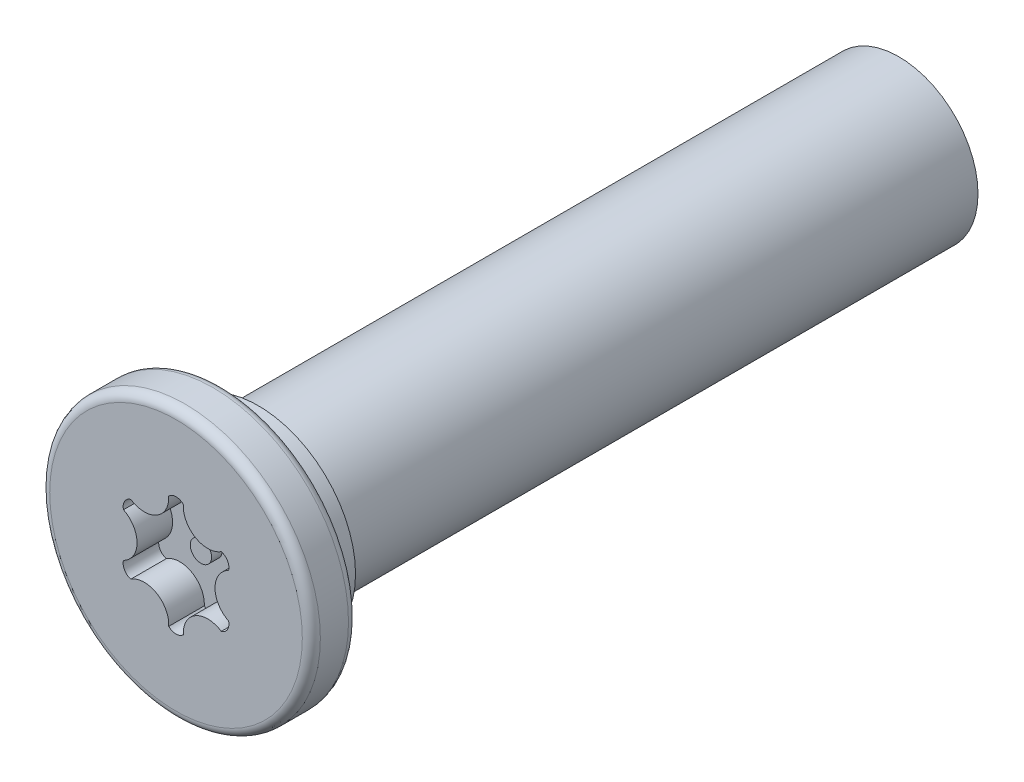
from build123d import *

# Parameters (mm, degrees)
SKETCH2_W           = 1.3
SKETCH2_H           = 3.81
SKETCH2_W_2         = 12.7
SKETCH2_H_2         = 2.23
CUT_EXTRUDE3_DEPTH  = 1
FILLET12_R          = 0.254
CUT_EXTRUDE6_START  = -12.7
SKETCH7_R           = 2.23
CUT_EXTRUDE6_DEPTH  = 12.7
SKETCH11_R          = 2.738000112
SKETCH11_R_2        = 2.230000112
BOSS_EXTRUDE1_DEPTH = 1.016
SKETCH12_R          = 2.230000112
BOSS_EXTRUDE2_DEPTH = 12.7
SKETCH14_R          = 0.3
BOSS_EXTRUDE4_DEPTH = 0.3
CUT_EXTRUDE7_START  = -12.7
SKETCH15_R          = 2.230000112
CUT_EXTRUDE7_DEPTH  = 12.7
SKETCH16_R          = 2.230000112
BOSS_EXTRUDE5_DEPTH = 19.05


with BuildPart() as part:
    # Sketch2 → Revolve1 (revolve)
    with BuildSketch(Plane(origin=(0, 0, 0), x_dir=(0, 0, -1), z_dir=(1, 0, 0)), mode=Mode.PRIVATE) as revolve1_sk:
        with Locations((0.65, 1.905)):
            Rectangle(SKETCH2_W, SKETCH2_H)
        with Locations((7.65, 1.115)):
            Rectangle(SKETCH2_W_2, SKETCH2_H_2)
    revolve(revolve1_sk.sketch.rotate(Axis((0, 0, -1.3), (0, 0, -1)), 90), axis=Axis((0, 0, -1.3), (0, 0, -1)))

    # Sketch3 → Cut-Extrude3 (cut)
    with BuildSketch(Plane.XY):
        with BuildLine():
            ThreePointArc((-0.205060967, 1.589373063), (0, 1.674312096), (0.205060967, 1.589373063))
            ThreePointArc((0.205060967, 1.589373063), (0.54882888, 0.950599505), (1.273906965, 0.972274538))
            ThreePointArc((1.273906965, 0.972274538), (1.449996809, 0.837156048), (1.478967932, 0.617098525))
            ThreePointArc((1.478967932, 0.617098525), (1.097657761, 0), (1.478967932, -0.617098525))
            ThreePointArc((1.478967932, -0.617098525), (1.449996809, -0.837156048), (1.273906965, -0.972274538))
            ThreePointArc((1.273906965, -0.972274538), (0.54882888, -0.950599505), (0.205060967, -1.589373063))
            ThreePointArc((0.205060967, -1.589373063), (0, -1.674312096), (-0.205060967, -1.589373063))
            ThreePointArc((-0.205060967, -1.589373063), (-0.54882888, -0.950599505), (-1.273906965, -0.972274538))
            ThreePointArc((-1.273906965, -0.972274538), (-1.449996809, -0.837156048), (-1.478967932, -0.617098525))
            ThreePointArc((-1.478967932, -0.617098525), (-1.097657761, 0), (-1.478967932, 0.617098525))
            ThreePointArc((-1.478967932, 0.617098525), (-1.449996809, 0.837156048), (-1.273906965, 0.972274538))
            ThreePointArc((-1.273906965, 0.972274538), (-0.54882888, 0.950599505), (-0.205060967, 1.589373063))
        make_face()
    extrude(amount=-CUT_EXTRUDE3_DEPTH, mode=Mode.SUBTRACT)

    # Fillet12
    fillet12_edges = [part.edges().sort_by_distance(p)[0] for p in [
        (-3.81, 0, 0),
        (-3.81, 0, -1.3),
    ]]
    fillet(fillet12_edges, radius=FILLET12_R)

    # Sketch7 → Cut-Extrude6 (cut)
    with BuildSketch(Plane(origin=(0, 0, -14), x_dir=(-1, 0, 0), z_dir=(0, 0, -1)).offset(CUT_EXTRUDE6_START)):
        Circle(SKETCH7_R)
    extrude(amount=CUT_EXTRUDE6_DEPTH, mode=Mode.SUBTRACT)

    # Sketch11 → Boss-Extrude1 (add)
    with BuildSketch(Plane(origin=(0, 0, -1.3), x_dir=(-1, 0, 0), z_dir=(0, 0, -1))):
        with Locations(Location((0, 0, 0), (0, 0, 180))):
            Circle(SKETCH11_R)
        Circle(SKETCH11_R_2, mode=Mode.SUBTRACT)
    extrude(amount=BOSS_EXTRUDE1_DEPTH)

    # Sketch12 → Boss-Extrude2 (add)
    with BuildSketch(Plane(origin=(0, 0, -1.3), x_dir=(-1, 0, 0), z_dir=(0, 0, -1))):
        Circle(SKETCH12_R)
    extrude(amount=BOSS_EXTRUDE2_DEPTH)

    # Sketch14 → Boss-Extrude4 (add)
    with BuildSketch(Plane.XY.offset(-1)):
        Circle(SKETCH14_R)
    extrude(amount=BOSS_EXTRUDE4_DEPTH)

    # Sketch15 → Cut-Extrude7 (cut)
    with BuildSketch(Plane(origin=(0, 0, -14), x_dir=(-1, 0, 0), z_dir=(0, 0, -1)).offset(CUT_EXTRUDE7_START)):
        Circle(SKETCH15_R)
    extrude(amount=CUT_EXTRUDE7_DEPTH, mode=Mode.SUBTRACT)

    # Sketch16 → Boss-Extrude5 (add)
    with BuildSketch(Plane(origin=(0, 0, -1.3), x_dir=(-1, 0, 0), z_dir=(0, 0, -1))):
        with Locations(Location((0, 0, 0), (0, 0, 180))):
            Circle(SKETCH16_R)
    extrude(amount=BOSS_EXTRUDE5_DEPTH)


solid = part.part
